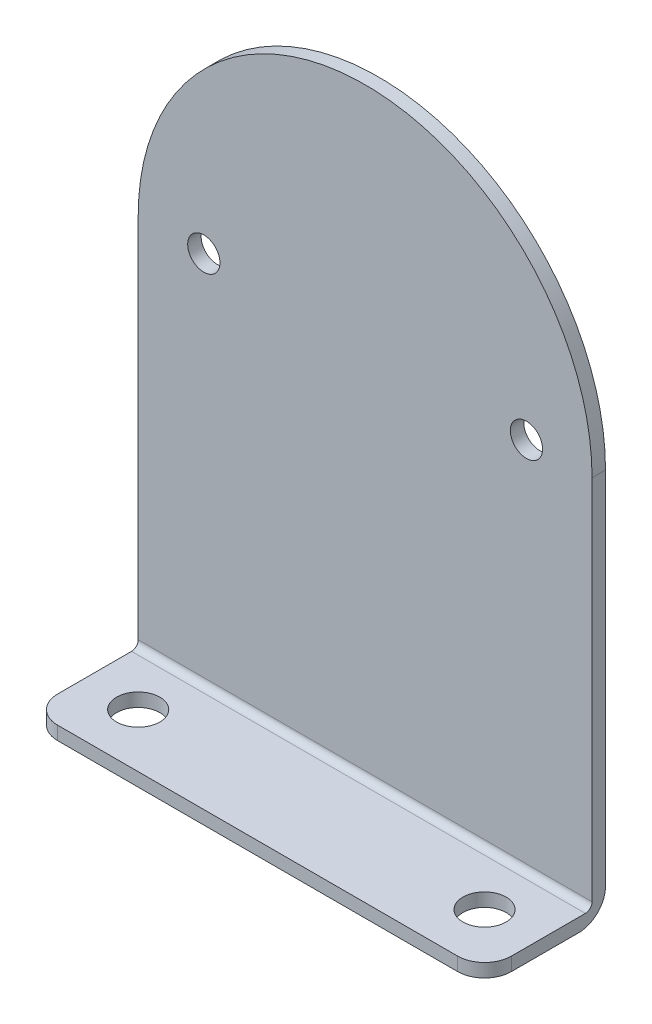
ISO-10303-21;
HEADER;
FILE_DESCRIPTION(('STEP AP214'),'2;1');
FILE_NAME('part.step','',(''),(''),'','','');
FILE_SCHEMA(('AUTOMOTIVE_DESIGN { 1 0 10303 214 1 1 1 1 }'));
ENDSEC;
DATA;
#1=APPLICATION_CONTEXT('core data for automotive mechanical design processes');
#2=APPLICATION_PROTOCOL_DEFINITION('international standard','automotive_design',2000,#1);
#3=PRODUCT_CONTEXT('',#1,'mechanical');
#4=PRODUCT('Part','Part','',(#3));
#5=PRODUCT_RELATED_PRODUCT_CATEGORY('part','',(#4));
#6=PRODUCT_DEFINITION_FORMATION('','',#4);
#7=PRODUCT_DEFINITION_CONTEXT('part definition',#1,'design');
#8=PRODUCT_DEFINITION('design','',#6,#7);
#9=PRODUCT_DEFINITION_SHAPE('','',#8);
#10=(LENGTH_UNIT() NAMED_UNIT(*) SI_UNIT(.MILLI.,.METRE.));
#11=(NAMED_UNIT(*) PLANE_ANGLE_UNIT() SI_UNIT($,.RADIAN.));
#12=(NAMED_UNIT(*) SI_UNIT($,.STERADIAN.) SOLID_ANGLE_UNIT());
#13=UNCERTAINTY_MEASURE_WITH_UNIT(LENGTH_MEASURE(1.E-05),#10,'distance_accuracy_value','');
#14=(GEOMETRIC_REPRESENTATION_CONTEXT(3) GLOBAL_UNCERTAINTY_ASSIGNED_CONTEXT((#13)) GLOBAL_UNIT_ASSIGNED_CONTEXT((#10,
#11,#12)) REPRESENTATION_CONTEXT('',''));
#15=CARTESIAN_POINT('',(0.,0.,0.));
#16=DIRECTION('',(0.,0.,1.));
#17=DIRECTION('',(1.,0.,0.));
#18=AXIS2_PLACEMENT_3D('',#15,#16,#17);
#19=CARTESIAN_POINT('',(-23.622,-45.348525,11.1125));
#20=DIRECTION('',(0.,1.,0.));
#21=DIRECTION('',(0.,0.,1.));
#22=AXIS2_PLACEMENT_3D('',#19,#20,#21);
#23=CYLINDRICAL_SURFACE('',#22,3.175);
#24=CARTESIAN_POINT('',(-23.622,-45.7454,11.1125));
#25=DIRECTION('',(0.,1.,0.));
#26=DIRECTION('',(0.,0.,1.));
#27=AXIS2_PLACEMENT_3D('',#24,#25,#26);
#28=CIRCLE('',#27,3.175);
#29=CARTESIAN_POINT('',(-23.622,-45.7454,14.2875));
#30=VERTEX_POINT('',#29);
#31=CARTESIAN_POINT('',(-26.797,-45.7454,11.1125));
#32=VERTEX_POINT('',#31);
#33=EDGE_CURVE('E140',#30,#32,#28,.F.);
#34=ORIENTED_EDGE('',*,*,#33,.F.);
#35=DIRECTION('',(0.,1.,0.));
#36=VECTOR('',#35,1.);
#37=CARTESIAN_POINT('',(-23.622,-44.95165,14.2875));
#38=LINE('',#37,#36);
#39=CARTESIAN_POINT('',(-23.622,-44.1579,14.2875));
#40=VERTEX_POINT('',#39);
#41=EDGE_CURVE('E103',#40,#30,#38,.F.);
#42=ORIENTED_EDGE('',*,*,#41,.F.);
#43=CARTESIAN_POINT('',(-23.622,-44.1579,11.1125));
#44=DIRECTION('',(0.,1.,0.));
#45=DIRECTION('',(0.,0.,1.));
#46=AXIS2_PLACEMENT_3D('',#43,#44,#45);
#47=CIRCLE('',#46,3.175);
#48=CARTESIAN_POINT('',(-26.797,-44.1579,11.1125));
#49=VERTEX_POINT('',#48);
#50=EDGE_CURVE('E138',#49,#40,#47,.T.);
#51=ORIENTED_EDGE('',*,*,#50,.F.);
#52=DIRECTION('',(0.,1.,0.));
#53=VECTOR('',#52,1.);
#54=CARTESIAN_POINT('',(-26.797,-45.348525,11.1125));
#55=LINE('',#54,#53);
#56=EDGE_CURVE('E144',#49,#32,#55,.F.);
#57=ORIENTED_EDGE('',*,*,#56,.T.);
#58=EDGE_LOOP('',(#34,#42,#51,#57));
#59=FACE_BOUND('',#58,.T.);
#60=ADVANCED_FACE('F16',(#59),#23,.T.);
#61=CARTESIAN_POINT('',(-1.764560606E-13,-44.95165,14.2875));
#62=DIRECTION('',(0.,0.,1.));
#63=DIRECTION('',(1.,0.,0.));
#64=AXIS2_PLACEMENT_3D('',#61,#62,#63);
#65=PLANE('',#64);
#66=ORIENTED_EDGE('',*,*,#41,.T.);
#67=DIRECTION('',(1.,0.,0.));
#68=VECTOR('',#67,1.);
#69=CARTESIAN_POINT('',(26.7969999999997,-45.7454,14.2875));
#70=LINE('',#69,#68);
#71=CARTESIAN_POINT('',(23.6219999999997,-45.7454,14.2875));
#72=VERTEX_POINT('',#71);
#73=EDGE_CURVE('E111',#72,#30,#70,.F.);
#74=ORIENTED_EDGE('',*,*,#73,.F.);
#75=DIRECTION('',(0.,-1.,0.));
#76=VECTOR('',#75,1.);
#77=CARTESIAN_POINT('',(23.6219999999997,-22.4758250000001,14.2875));
#78=LINE('',#77,#76);
#79=CARTESIAN_POINT('',(23.6219999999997,-44.1579,14.2875));
#80=VERTEX_POINT('',#79);
#81=EDGE_CURVE('E102',#80,#72,#78,.T.);
#82=ORIENTED_EDGE('',*,*,#81,.F.);
#83=DIRECTION('',(1.,0.,0.));
#84=VECTOR('',#83,1.);
#85=CARTESIAN_POINT('',(-26.797,-44.1579,14.2875));
#86=LINE('',#85,#84);
#87=EDGE_CURVE('E134',#40,#80,#86,.T.);
#88=ORIENTED_EDGE('',*,*,#87,.F.);
#89=EDGE_LOOP('',(#66,#74,#82,#88));
#90=FACE_BOUND('',#89,.T.);
#91=ADVANCED_FACE('F222',(#90),#65,.T.);
#92=CARTESIAN_POINT('',(23.6219999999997,-22.4758250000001,11.1125));
#93=DIRECTION('',(0.,-1.,0.));
#94=DIRECTION('',(0.,0.,-1.));
#95=AXIS2_PLACEMENT_3D('',#92,#93,#94);
#96=CYLINDRICAL_SURFACE('',#95,3.175);
#97=CARTESIAN_POINT('',(23.6219999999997,-44.1579,11.1125));
#98=DIRECTION('',(0.,-1.,0.));
#99=DIRECTION('',(0.,0.,-1.));
#100=AXIS2_PLACEMENT_3D('',#97,#98,#99);
#101=CIRCLE('',#100,3.175);
#102=CARTESIAN_POINT('',(26.7969999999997,-44.1579,11.1125));
#103=VERTEX_POINT('',#102);
#104=EDGE_CURVE('E137',#80,#103,#101,.F.);
#105=ORIENTED_EDGE('',*,*,#104,.F.);
#106=ORIENTED_EDGE('',*,*,#81,.T.);
#107=CARTESIAN_POINT('',(23.6219999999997,-45.7454,11.1125));
#108=DIRECTION('',(0.,-1.,0.));
#109=DIRECTION('',(0.,0.,-1.));
#110=AXIS2_PLACEMENT_3D('',#107,#108,#109);
#111=CIRCLE('',#110,3.175);
#112=CARTESIAN_POINT('',(26.7969999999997,-45.7454,11.1125));
#113=VERTEX_POINT('',#112);
#114=EDGE_CURVE('E19',#113,#72,#111,.T.);
#115=ORIENTED_EDGE('',*,*,#114,.F.);
#116=DIRECTION('',(0.,-1.,0.));
#117=VECTOR('',#116,1.);
#118=CARTESIAN_POINT('',(26.7969999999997,-22.4758250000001,11.1125));
#119=LINE('',#118,#117);
#120=EDGE_CURVE('E90',#113,#103,#119,.F.);
#121=ORIENTED_EDGE('',*,*,#120,.T.);
#122=EDGE_LOOP('',(#105,#106,#115,#121));
#123=FACE_BOUND('',#122,.T.);
#124=ADVANCED_FACE('F107',(#123),#96,.T.);
#125=CARTESIAN_POINT('',(20.4469999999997,-135.475200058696,7.9375));
#126=DIRECTION('',(0.,1.,0.));
#127=DIRECTION('',(0.,0.,1.));
#128=AXIS2_PLACEMENT_3D('',#125,#126,#127);
#129=CYLINDRICAL_SURFACE('',#128,2.5527);
#130=CARTESIAN_POINT('',(20.4469999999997,-44.1579,7.9375));
#131=DIRECTION('',(0.,1.,0.));
#132=DIRECTION('',(0.,0.,1.));
#133=AXIS2_PLACEMENT_3D('',#130,#131,#132);
#134=CIRCLE('',#133,2.5527);
#135=CARTESIAN_POINT('',(20.4469999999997,-44.1579,10.4902));
#136=VERTEX_POINT('',#135);
#137=EDGE_CURVE('E174',#136,#136,#134,.F.);
#138=ORIENTED_EDGE('',*,*,#137,.F.);
#139=EDGE_LOOP('',(#138));
#140=FACE_BOUND('',#139,.T.);
#141=CARTESIAN_POINT('',(20.4469999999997,-45.7454,7.9375));
#142=DIRECTION('',(0.,1.,0.));
#143=DIRECTION('',(0.,0.,1.));
#144=AXIS2_PLACEMENT_3D('',#141,#142,#143);
#145=CIRCLE('',#144,2.5527);
#146=CARTESIAN_POINT('',(20.4469999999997,-45.7454,10.4902));
#147=VERTEX_POINT('',#146);
#148=EDGE_CURVE('E180',#147,#147,#145,.T.);
#149=ORIENTED_EDGE('',*,*,#148,.F.);
#150=EDGE_LOOP('',(#149));
#151=FACE_BOUND('',#150,.T.);
#152=ADVANCED_FACE('F265',(#140,#151),#129,.F.);
#153=CARTESIAN_POINT('',(-20.447,-135.475200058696,7.9375));
#154=DIRECTION('',(0.,1.,0.));
#155=DIRECTION('',(0.,0.,1.));
#156=AXIS2_PLACEMENT_3D('',#153,#154,#155);
#157=CYLINDRICAL_SURFACE('',#156,2.5527);
#158=CARTESIAN_POINT('',(-20.447,-44.1579,7.9375));
#159=DIRECTION('',(0.,1.,0.));
#160=DIRECTION('',(0.,0.,1.));
#161=AXIS2_PLACEMENT_3D('',#158,#159,#160);
#162=CIRCLE('',#161,2.5527);
#163=CARTESIAN_POINT('',(-20.447,-44.1579,10.4902));
#164=VERTEX_POINT('',#163);
#165=EDGE_CURVE('E132',#164,#164,#162,.F.);
#166=ORIENTED_EDGE('',*,*,#165,.F.);
#167=EDGE_LOOP('',(#166));
#168=FACE_BOUND('',#167,.T.);
#169=CARTESIAN_POINT('',(-20.447,-45.7454,7.9375));
#170=DIRECTION('',(0.,1.,0.));
#171=DIRECTION('',(0.,0.,1.));
#172=AXIS2_PLACEMENT_3D('',#169,#170,#171);
#173=CIRCLE('',#172,2.5527);
#174=CARTESIAN_POINT('',(-20.447,-45.7454,10.4902));
#175=VERTEX_POINT('',#174);
#176=EDGE_CURVE('E183',#175,#175,#173,.T.);
#177=ORIENTED_EDGE('',*,*,#176,.F.);
#178=EDGE_LOOP('',(#177));
#179=FACE_BOUND('',#178,.T.);
#180=ADVANCED_FACE('F262',(#168,#179),#157,.F.);
#181=CARTESIAN_POINT('',(13.3984999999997,-42.5704,3.175));
#182=DIRECTION('',(1.,0.,0.));
#183=DIRECTION('',(0.,0.,-1.));
#184=AXIS2_PLACEMENT_3D('',#181,#182,#183);
#185=CYLINDRICAL_SURFACE('',#184,3.175);
#186=CARTESIAN_POINT('',(-26.797,-42.5704,3.175));
#187=DIRECTION('',(1.,0.,0.));
#188=DIRECTION('',(0.,0.,-1.));
#189=AXIS2_PLACEMENT_3D('',#186,#187,#188);
#190=CIRCLE('',#189,3.175);
#191=CARTESIAN_POINT('',(-26.797,-42.5704,0.));
#192=VERTEX_POINT('',#191);
#193=CARTESIAN_POINT('',(-26.797,-45.7454,3.175));
#194=VERTEX_POINT('',#193);
#195=EDGE_CURVE('E165',#192,#194,#190,.F.);
#196=ORIENTED_EDGE('',*,*,#195,.F.);
#197=DIRECTION('',(1.,0.,0.));
#198=VECTOR('',#197,1.);
#199=CARTESIAN_POINT('',(-1.754152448E-13,-42.5704,0.));
#200=LINE('',#199,#198);
#201=CARTESIAN_POINT('',(26.7969999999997,-42.5704,0.));
#202=VERTEX_POINT('',#201);
#203=EDGE_CURVE('E129',#192,#202,#200,.T.);
#204=ORIENTED_EDGE('',*,*,#203,.T.);
#205=CARTESIAN_POINT('',(26.7969999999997,-42.5704,3.175));
#206=DIRECTION('',(1.,0.,0.));
#207=DIRECTION('',(0.,0.,-1.));
#208=AXIS2_PLACEMENT_3D('',#205,#206,#207);
#209=CIRCLE('',#208,3.175);
#210=CARTESIAN_POINT('',(26.7969999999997,-45.7454,3.175));
#211=VERTEX_POINT('',#210);
#212=EDGE_CURVE('E128',#211,#202,#209,.T.);
#213=ORIENTED_EDGE('',*,*,#212,.F.);
#214=DIRECTION('',(1.,0.,0.));
#215=VECTOR('',#214,1.);
#216=CARTESIAN_POINT('',(26.7969999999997,-45.7454,3.175));
#217=LINE('',#216,#215);
#218=EDGE_CURVE('E112',#194,#211,#217,.T.);
#219=ORIENTED_EDGE('',*,*,#218,.F.);
#220=EDGE_LOOP('',(#196,#204,#213,#219));
#221=FACE_BOUND('',#220,.T.);
#222=ADVANCED_FACE('F211',(#221),#185,.T.);
#223=CARTESIAN_POINT('',(26.7969999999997,-45.7454,0.));
#224=DIRECTION('',(0.,-1.,0.));
#225=DIRECTION('',(0.,0.,-1.));
#226=AXIS2_PLACEMENT_3D('',#223,#224,#225);
#227=PLANE('',#226);
#228=ORIENTED_EDGE('',*,*,#148,.T.);
#229=EDGE_LOOP('',(#228));
#230=FACE_BOUND('',#229,.T.);
#231=ORIENTED_EDGE('',*,*,#176,.T.);
#232=EDGE_LOOP('',(#231));
#233=FACE_BOUND('',#232,.T.);
#234=ORIENTED_EDGE('',*,*,#33,.T.);
#235=DIRECTION('',(0.,0.,1.));
#236=VECTOR('',#235,1.);
#237=CARTESIAN_POINT('',(-26.797,-45.7454,0.));
#238=LINE('',#237,#236);
#239=EDGE_CURVE('E168',#194,#32,#238,.T.);
#240=ORIENTED_EDGE('',*,*,#239,.F.);
#241=ORIENTED_EDGE('',*,*,#218,.T.);
#242=DIRECTION('',(0.,0.,-1.));
#243=VECTOR('',#242,1.);
#244=CARTESIAN_POINT('',(26.7969999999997,-45.7454,0.));
#245=LINE('',#244,#243);
#246=EDGE_CURVE('E95',#113,#211,#245,.T.);
#247=ORIENTED_EDGE('',*,*,#246,.F.);
#248=ORIENTED_EDGE('',*,*,#114,.T.);
#249=ORIENTED_EDGE('',*,*,#73,.T.);
#250=EDGE_LOOP('',(#234,#240,#241,#247,#248,#249));
#251=FACE_BOUND('',#250,.T.);
#252=ADVANCED_FACE('F115',(#230,#233,#251),#227,.T.);
#253=CARTESIAN_POINT('',(-26.797,-44.1579,1.5875));
#254=DIRECTION('',(0.,1.,0.));
#255=DIRECTION('',(0.,0.,1.));
#256=AXIS2_PLACEMENT_3D('',#253,#254,#255);
#257=PLANE('',#256);
#258=ORIENTED_EDGE('',*,*,#165,.T.);
#259=EDGE_LOOP('',(#258));
#260=FACE_BOUND('',#259,.T.);
#261=ORIENTED_EDGE('',*,*,#137,.T.);
#262=EDGE_LOOP('',(#261));
#263=FACE_BOUND('',#262,.T.);
#264=ORIENTED_EDGE('',*,*,#104,.T.);
#265=DIRECTION('',(0.,0.,-1.));
#266=VECTOR('',#265,1.);
#267=CARTESIAN_POINT('',(26.7969999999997,-44.1579,0.));
#268=LINE('',#267,#266);
#269=CARTESIAN_POINT('',(26.7969999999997,-44.1579,2.38125));
#270=VERTEX_POINT('',#269);
#271=EDGE_CURVE('E98',#270,#103,#268,.F.);
#272=ORIENTED_EDGE('',*,*,#271,.F.);
#273=DIRECTION('',(1.,0.,0.));
#274=VECTOR('',#273,1.);
#275=CARTESIAN_POINT('',(-13.3985000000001,-44.1579,2.38125));
#276=LINE('',#275,#274);
#277=CARTESIAN_POINT('',(-26.797,-44.1579,2.38125));
#278=VERTEX_POINT('',#277);
#279=EDGE_CURVE('E131',#270,#278,#276,.F.);
#280=ORIENTED_EDGE('',*,*,#279,.T.);
#281=DIRECTION('',(0.,0.,1.));
#282=VECTOR('',#281,1.);
#283=CARTESIAN_POINT('',(-26.797,-44.1579,0.));
#284=LINE('',#283,#282);
#285=EDGE_CURVE('E164',#49,#278,#284,.F.);
#286=ORIENTED_EDGE('',*,*,#285,.F.);
#287=ORIENTED_EDGE('',*,*,#50,.T.);
#288=ORIENTED_EDGE('',*,*,#87,.T.);
#289=EDGE_LOOP('',(#264,#272,#280,#286,#287,#288));
#290=FACE_BOUND('',#289,.T.);
#291=ADVANCED_FACE('F219',(#260,#263,#290),#257,.T.);
#292=CARTESIAN_POINT('',(-1.754152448E-13,-25.4684949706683,0.));
#293=DIRECTION('',(0.,0.,1.));
#294=DIRECTION('',(1.,0.,0.));
#295=AXIS2_PLACEMENT_3D('',#292,#293,#294);
#296=PLANE('',#295);
#297=CARTESIAN_POINT('',(-19.0500000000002,-1.254551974E-13,0.));
#298=DIRECTION('',(0.,0.,1.));
#299=DIRECTION('',(1.,0.,0.));
#300=AXIS2_PLACEMENT_3D('',#297,#298,#299);
#301=CIRCLE('',#300,1.905);
#302=CARTESIAN_POINT('',(-17.1450000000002,-1.254551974E-13,0.));
#303=VERTEX_POINT('',#302);
#304=EDGE_CURVE('E153',#303,#303,#301,.T.);
#305=ORIENTED_EDGE('',*,*,#304,.T.);
#306=EDGE_LOOP('',(#305));
#307=FACE_BOUND('',#306,.T.);
#308=CARTESIAN_POINT('',(19.0499999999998,-1.254551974E-13,0.));
#309=DIRECTION('',(0.,0.,1.));
#310=DIRECTION('',(1.,0.,0.));
#311=AXIS2_PLACEMENT_3D('',#308,#309,#310);
#312=CIRCLE('',#311,1.905);
#313=CARTESIAN_POINT('',(20.9549999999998,-1.254551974E-13,0.));
#314=VERTEX_POINT('',#313);
#315=EDGE_CURVE('E157',#314,#314,#312,.T.);
#316=ORIENTED_EDGE('',*,*,#315,.T.);
#317=EDGE_LOOP('',(#316));
#318=FACE_BOUND('',#317,.T.);
#319=DIRECTION('',(0.,1.,0.));
#320=VECTOR('',#319,1.);
#321=CARTESIAN_POINT('',(-26.797,-45.7454,0.));
#322=LINE('',#321,#320);
#323=CARTESIAN_POINT('',(-26.797,-1.25177643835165E-13,0.));
#324=VERTEX_POINT('',#323);
#325=EDGE_CURVE('E160',#324,#192,#322,.F.);
#326=ORIENTED_EDGE('',*,*,#325,.F.);
#327=CARTESIAN_POINT('',(-1.731948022E-13,-1.254551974E-13,0.));
#328=DIRECTION('',(0.,0.,1.));
#329=DIRECTION('',(1.,0.,0.));
#330=AXIS2_PLACEMENT_3D('',#327,#328,#329);
#331=CIRCLE('',#330,26.7969999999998);
#332=CARTESIAN_POINT('',(26.7969999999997,-1.254551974E-13,0.));
#333=VERTEX_POINT('',#332);
#334=EDGE_CURVE('E120',#333,#324,#331,.T.);
#335=ORIENTED_EDGE('',*,*,#334,.F.);
#336=DIRECTION('',(0.,1.,0.));
#337=VECTOR('',#336,1.);
#338=CARTESIAN_POINT('',(26.7969999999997,-1.254551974E-13,0.));
#339=LINE('',#338,#337);
#340=EDGE_CURVE('E126',#202,#333,#339,.T.);
#341=ORIENTED_EDGE('',*,*,#340,.F.);
#342=ORIENTED_EDGE('',*,*,#203,.F.);
#343=EDGE_LOOP('',(#326,#335,#341,#342));
#344=FACE_BOUND('',#343,.T.);
#345=ADVANCED_FACE('F208',(#307,#318,#344),#296,.F.);
#346=CARTESIAN_POINT('',(-13.3985000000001,-43.36415,2.38125));
#347=DIRECTION('',(1.,0.,0.));
#348=DIRECTION('',(0.,0.,-1.));
#349=AXIS2_PLACEMENT_3D('',#346,#347,#348);
#350=CYLINDRICAL_SURFACE('',#349,0.79375);
#351=ORIENTED_EDGE('',*,*,#279,.F.);
#352=CARTESIAN_POINT('',(26.7969999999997,-43.36415,2.38125));
#353=DIRECTION('',(1.,0.,0.));
#354=DIRECTION('',(0.,0.,-1.));
#355=AXIS2_PLACEMENT_3D('',#352,#353,#354);
#356=CIRCLE('',#355,0.79375);
#357=CARTESIAN_POINT('',(26.7969999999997,-43.36415,1.5875));
#358=VERTEX_POINT('',#357);
#359=EDGE_CURVE('E122',#358,#270,#356,.F.);
#360=ORIENTED_EDGE('',*,*,#359,.F.);
#361=DIRECTION('',(1.,0.,0.));
#362=VECTOR('',#361,1.);
#363=CARTESIAN_POINT('',(-1.754152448E-13,-43.36415,1.5875));
#364=LINE('',#363,#362);
#365=CARTESIAN_POINT('',(-26.797,-43.36415,1.5875));
#366=VERTEX_POINT('',#365);
#367=EDGE_CURVE('E156',#366,#358,#364,.T.);
#368=ORIENTED_EDGE('',*,*,#367,.F.);
#369=CARTESIAN_POINT('',(-26.797,-43.36415,2.38125));
#370=DIRECTION('',(1.,0.,0.));
#371=DIRECTION('',(0.,0.,-1.));
#372=AXIS2_PLACEMENT_3D('',#369,#370,#371);
#373=CIRCLE('',#372,0.79375);
#374=EDGE_CURVE('E161',#278,#366,#373,.T.);
#375=ORIENTED_EDGE('',*,*,#374,.F.);
#376=EDGE_LOOP('',(#351,#360,#368,#375));
#377=FACE_BOUND('',#376,.T.);
#378=ADVANCED_FACE('F217',(#377),#350,.F.);
#379=CARTESIAN_POINT('',(26.7969999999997,-1.254551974E-13,0.));
#380=DIRECTION('',(1.,0.,0.));
#381=DIRECTION('',(0.,0.,-1.));
#382=AXIS2_PLACEMENT_3D('',#379,#380,#381);
#383=PLANE('',#382);
#384=ORIENTED_EDGE('',*,*,#120,.F.);
#385=ORIENTED_EDGE('',*,*,#246,.T.);
#386=ORIENTED_EDGE('',*,*,#212,.T.);
#387=ORIENTED_EDGE('',*,*,#340,.T.);
#388=DIRECTION('',(0.,0.,1.));
#389=VECTOR('',#388,1.);
#390=CARTESIAN_POINT('',(26.7969999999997,-1.254551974E-13,0.));
#391=LINE('',#390,#389);
#392=CARTESIAN_POINT('',(26.7969999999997,-1.25316420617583E-13,1.5875));
#393=VERTEX_POINT('',#392);
#394=EDGE_CURVE('E117',#393,#333,#391,.F.);
#395=ORIENTED_EDGE('',*,*,#394,.F.);
#396=DIRECTION('',(0.,1.,0.));
#397=VECTOR('',#396,1.);
#398=CARTESIAN_POINT('',(26.7969999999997,-25.4684949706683,1.5875));
#399=LINE('',#398,#397);
#400=EDGE_CURVE('E152',#358,#393,#399,.T.);
#401=ORIENTED_EDGE('',*,*,#400,.F.);
#402=ORIENTED_EDGE('',*,*,#359,.T.);
#403=ORIENTED_EDGE('',*,*,#271,.T.);
#404=EDGE_LOOP('',(#384,#385,#386,#387,#395,#401,#402,#403));
#405=FACE_BOUND('',#404,.T.);
#406=ADVANCED_FACE('F92',(#405),#383,.T.);
#407=CARTESIAN_POINT('',(-1.731948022E-13,-1.254551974E-13,0.));
#408=DIRECTION('',(0.,0.,1.));
#409=DIRECTION('',(1.,0.,0.));
#410=AXIS2_PLACEMENT_3D('',#407,#408,#409);
#411=CYLINDRICAL_SURFACE('',#410,26.7969999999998);
#412=ORIENTED_EDGE('',*,*,#394,.T.);
#413=ORIENTED_EDGE('',*,*,#334,.T.);
#414=DIRECTION('',(0.,0.,1.));
#415=VECTOR('',#414,1.);
#416=CARTESIAN_POINT('',(-26.797,-1.2490009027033E-13,0.));
#417=LINE('',#416,#415);
#418=CARTESIAN_POINT('',(-26.797,-1.25177643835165E-13,1.5875));
#419=VERTEX_POINT('',#418);
#420=EDGE_CURVE('E34',#419,#324,#417,.F.);
#421=ORIENTED_EDGE('',*,*,#420,.F.);
#422=CARTESIAN_POINT('',(-1.731948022E-13,-1.254551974E-13,1.5875));
#423=DIRECTION('',(0.,0.,1.));
#424=DIRECTION('',(1.,0.,0.));
#425=AXIS2_PLACEMENT_3D('',#422,#423,#424);
#426=CIRCLE('',#425,26.7969999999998);
#427=EDGE_CURVE('E149',#393,#419,#426,.T.);
#428=ORIENTED_EDGE('',*,*,#427,.F.);
#429=EDGE_LOOP('',(#412,#413,#421,#428));
#430=FACE_BOUND('',#429,.T.);
#431=ADVANCED_FACE('F212',(#430),#411,.T.);
#432=CARTESIAN_POINT('',(-26.797,-45.7454,0.));
#433=DIRECTION('',(-1.,0.,0.));
#434=DIRECTION('',(0.,0.,1.));
#435=AXIS2_PLACEMENT_3D('',#432,#433,#434);
#436=PLANE('',#435);
#437=ORIENTED_EDGE('',*,*,#420,.T.);
#438=ORIENTED_EDGE('',*,*,#325,.T.);
#439=ORIENTED_EDGE('',*,*,#195,.T.);
#440=ORIENTED_EDGE('',*,*,#239,.T.);
#441=ORIENTED_EDGE('',*,*,#56,.F.);
#442=ORIENTED_EDGE('',*,*,#285,.T.);
#443=ORIENTED_EDGE('',*,*,#374,.T.);
#444=DIRECTION('',(0.,1.,0.));
#445=VECTOR('',#444,1.);
#446=CARTESIAN_POINT('',(-26.797,-25.4684949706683,1.5875));
#447=LINE('',#446,#445);
#448=EDGE_CURVE('E148',#419,#366,#447,.F.);
#449=ORIENTED_EDGE('',*,*,#448,.F.);
#450=EDGE_LOOP('',(#437,#438,#439,#440,#441,#442,#443,#449));
#451=FACE_BOUND('',#450,.T.);
#452=ADVANCED_FACE('F189',(#451),#436,.T.);
#453=CARTESIAN_POINT('',(19.0499999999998,-1.254551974E-13,-89.7298000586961));
#454=DIRECTION('',(0.,0.,1.));
#455=DIRECTION('',(1.,0.,0.));
#456=AXIS2_PLACEMENT_3D('',#453,#454,#455);
#457=CYLINDRICAL_SURFACE('',#456,1.905);
#458=CARTESIAN_POINT('',(19.0499999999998,-1.254551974E-13,1.58750000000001));
#459=DIRECTION('',(0.,0.,1.));
#460=DIRECTION('',(1.,0.,0.));
#461=AXIS2_PLACEMENT_3D('',#458,#459,#460);
#462=CIRCLE('',#461,1.905);
#463=CARTESIAN_POINT('',(20.9549999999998,-1.254551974E-13,1.58750000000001));
#464=VERTEX_POINT('',#463);
#465=EDGE_CURVE('E25',#464,#464,#462,.F.);
#466=ORIENTED_EDGE('',*,*,#465,.F.);
#467=EDGE_LOOP('',(#466));
#468=FACE_BOUND('',#467,.T.);
#469=ORIENTED_EDGE('',*,*,#315,.F.);
#470=EDGE_LOOP('',(#469));
#471=FACE_BOUND('',#470,.T.);
#472=ADVANCED_FACE('F235',(#468,#471),#457,.F.);
#473=CARTESIAN_POINT('',(-19.0500000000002,-1.254551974E-13,-89.7298000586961));
#474=DIRECTION('',(0.,0.,1.));
#475=DIRECTION('',(1.,0.,0.));
#476=AXIS2_PLACEMENT_3D('',#473,#474,#475);
#477=CYLINDRICAL_SURFACE('',#476,1.905);
#478=CARTESIAN_POINT('',(-19.0500000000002,-1.254551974E-13,1.58750000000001));
#479=DIRECTION('',(0.,0.,1.));
#480=DIRECTION('',(1.,0.,0.));
#481=AXIS2_PLACEMENT_3D('',#478,#479,#480);
#482=CIRCLE('',#481,1.905);
#483=CARTESIAN_POINT('',(-17.1450000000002,-1.254551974E-13,1.58750000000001));
#484=VERTEX_POINT('',#483);
#485=EDGE_CURVE('E11',#484,#484,#482,.F.);
#486=ORIENTED_EDGE('',*,*,#485,.F.);
#487=EDGE_LOOP('',(#486));
#488=FACE_BOUND('',#487,.T.);
#489=ORIENTED_EDGE('',*,*,#304,.F.);
#490=EDGE_LOOP('',(#489));
#491=FACE_BOUND('',#490,.T.);
#492=ADVANCED_FACE('F229',(#488,#491),#477,.F.);
#493=CARTESIAN_POINT('',(-1.754152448E-13,-25.4684949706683,1.5875));
#494=DIRECTION('',(0.,0.,1.));
#495=DIRECTION('',(1.,0.,0.));
#496=AXIS2_PLACEMENT_3D('',#493,#494,#495);
#497=PLANE('',#496);
#498=ORIENTED_EDGE('',*,*,#485,.T.);
#499=EDGE_LOOP('',(#498));
#500=FACE_BOUND('',#499,.T.);
#501=ORIENTED_EDGE('',*,*,#465,.T.);
#502=EDGE_LOOP('',(#501));
#503=FACE_BOUND('',#502,.T.);
#504=ORIENTED_EDGE('',*,*,#427,.T.);
#505=ORIENTED_EDGE('',*,*,#448,.T.);
#506=ORIENTED_EDGE('',*,*,#367,.T.);
#507=ORIENTED_EDGE('',*,*,#400,.T.);
#508=EDGE_LOOP('',(#504,#505,#506,#507));
#509=FACE_BOUND('',#508,.T.);
#510=ADVANCED_FACE('F213',(#500,#503,#509),#497,.T.);
#511=CLOSED_SHELL('',(#60,#91,#124,#152,#180,#222,#252,#291,#345,#378,#406,#431,#452,#472,#492,#510));
#512=MANIFOLD_SOLID_BREP('B1',#511);
#513=ADVANCED_BREP_SHAPE_REPRESENTATION('',(#18,#512),#14);
#514=SHAPE_DEFINITION_REPRESENTATION(#9,#513);
ENDSEC;
END-ISO-10303-21;
